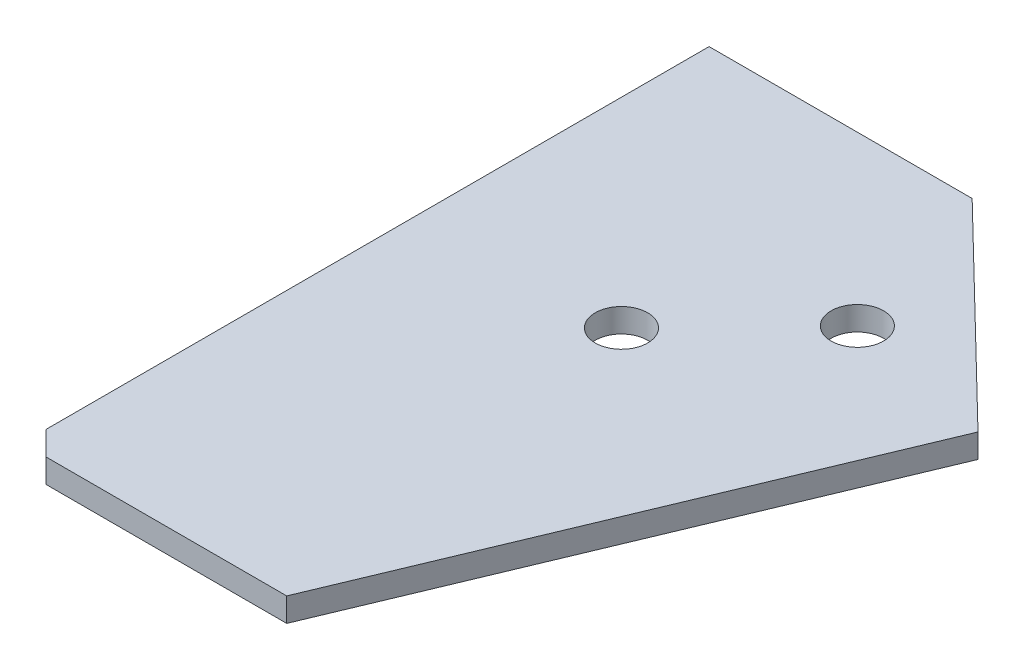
from build123d import *

# Parameters (mm, degrees)
BOSS_EXTRUDE1_DEPTH        = 5
F_22_0_22_DIAMETER_HOLE1_D = 22
CHAMFER2_SIZE              = 10


with BuildPart() as part:
    # Sketch1 → Boss-Extrude1 (new, symmetric)
    with BuildSketch(Plane(origin=(0, 0, 0), x_dir=(1, 0, 0), z_dir=(0, 1, 0))):
        Polygon((111, 0), (196.451283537, 204.607542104), (110.379713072, 288.223836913), (0, 288.223836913), (0, 0), align=None)
    extrude(amount=BOSS_EXTRUDE1_DEPTH, both=True)

    # 22.0 _22_ Diameter Hole1 (through all)
    with Locations(Plane(origin=(0, 5, 0), x_dir=(-1, 0, 0), z_dir=(0, 1, 0))):
        with Locations((-132.613727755, -217.827469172), (-83.837555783, -167.619053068)):
            Hole(F_22_0_22_DIAMETER_HOLE1_D / 2)

    # Chamfer2
    chamfer2_edges = [part.edges().sort_by_distance(p)[0] for p in [
        (0, 0, 0),
    ]]
    chamfer(chamfer2_edges, length=CHAMFER2_SIZE)


solid = part.part
